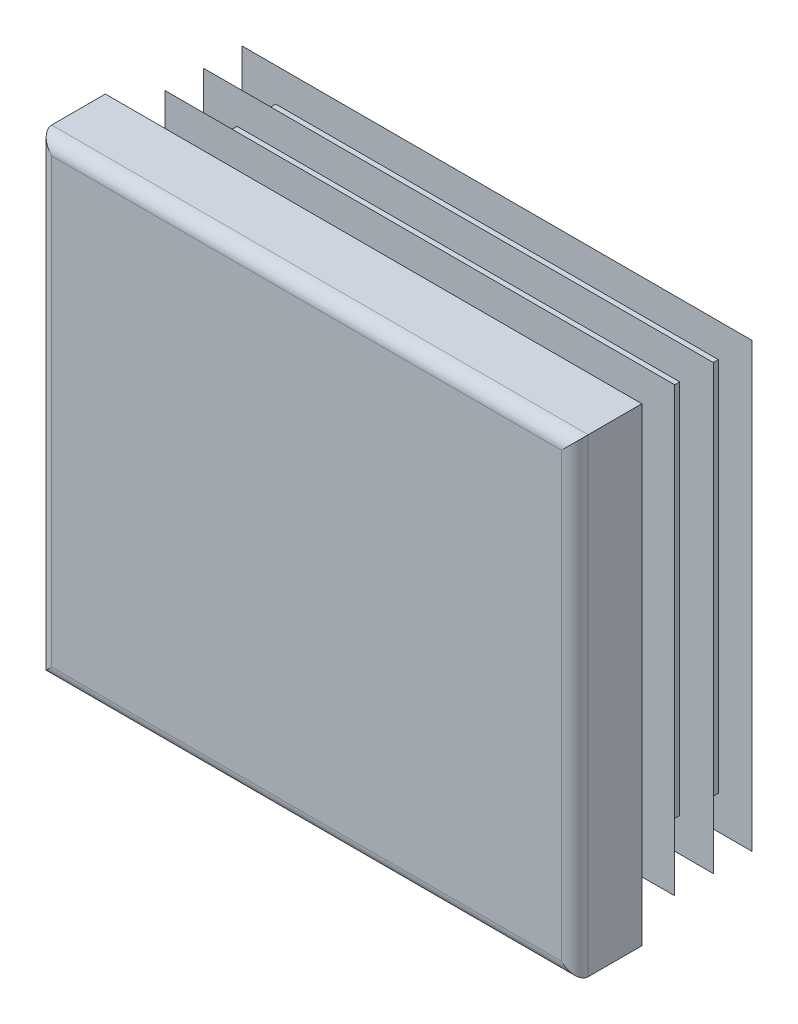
ISO-10303-21;
HEADER;
FILE_DESCRIPTION(('STEP AP214'),'2;1');
FILE_NAME('part.step','',(''),(''),'','','');
FILE_SCHEMA(('AUTOMOTIVE_DESIGN { 1 0 10303 214 1 1 1 1 }'));
ENDSEC;
DATA;
#1=APPLICATION_CONTEXT('core data for automotive mechanical design processes');
#2=APPLICATION_PROTOCOL_DEFINITION('international standard','automotive_design',2000,#1);
#3=PRODUCT_CONTEXT('',#1,'mechanical');
#4=PRODUCT('Part','Part','',(#3));
#5=PRODUCT_RELATED_PRODUCT_CATEGORY('part','',(#4));
#6=PRODUCT_DEFINITION_FORMATION('','',#4);
#7=PRODUCT_DEFINITION_CONTEXT('part definition',#1,'design');
#8=PRODUCT_DEFINITION('design','',#6,#7);
#9=PRODUCT_DEFINITION_SHAPE('','',#8);
#10=(LENGTH_UNIT() NAMED_UNIT(*) SI_UNIT(.MILLI.,.METRE.));
#11=(NAMED_UNIT(*) PLANE_ANGLE_UNIT() SI_UNIT($,.RADIAN.));
#12=(NAMED_UNIT(*) SI_UNIT($,.STERADIAN.) SOLID_ANGLE_UNIT());
#13=UNCERTAINTY_MEASURE_WITH_UNIT(LENGTH_MEASURE(1.E-05),#10,'distance_accuracy_value','');
#14=(GEOMETRIC_REPRESENTATION_CONTEXT(3) GLOBAL_UNCERTAINTY_ASSIGNED_CONTEXT((#13)) GLOBAL_UNIT_ASSIGNED_CONTEXT((#10,
#11,#12)) REPRESENTATION_CONTEXT('',''));
#15=CARTESIAN_POINT('',(0.,0.,0.));
#16=DIRECTION('',(0.,0.,1.));
#17=DIRECTION('',(1.,0.,0.));
#18=AXIS2_PLACEMENT_3D('',#15,#16,#17);
#19=CARTESIAN_POINT('',(19.,-17.5,5.));
#20=DIRECTION('',(0.,0.,-1.));
#21=DIRECTION('',(0.,1.,0.));
#22=AXIS2_PLACEMENT_3D('',#19,#20,#21);
#23=PLANE('',#22);
#24=DIRECTION('',(0.,1.,0.));
#25=VECTOR('',#24,1.);
#26=CARTESIAN_POINT('',(-19.,-17.5,5.));
#27=LINE('',#26,#25);
#28=CARTESIAN_POINT('',(-19.,-16.5,5.));
#29=VERTEX_POINT('',#28);
#30=CARTESIAN_POINT('',(-19.,16.5,5.));
#31=VERTEX_POINT('',#30);
#32=EDGE_CURVE('E310',#29,#31,#27,.T.);
#33=ORIENTED_EDGE('',*,*,#32,.F.);
#34=DIRECTION('',(-1.,0.,0.));
#35=VECTOR('',#34,1.);
#36=CARTESIAN_POINT('',(20.,-16.5,5.));
#37=LINE('',#36,#35);
#38=CARTESIAN_POINT('',(19.,-16.5,5.));
#39=VERTEX_POINT('',#38);
#40=EDGE_CURVE('E482',#39,#29,#37,.T.);
#41=ORIENTED_EDGE('',*,*,#40,.F.);
#42=DIRECTION('',(0.,1.,0.));
#43=VECTOR('',#42,1.);
#44=CARTESIAN_POINT('',(19.,-17.5,5.));
#45=LINE('',#44,#43);
#46=CARTESIAN_POINT('',(19.,16.5,5.));
#47=VERTEX_POINT('',#46);
#48=EDGE_CURVE('E305',#39,#47,#45,.T.);
#49=ORIENTED_EDGE('',*,*,#48,.T.);
#50=DIRECTION('',(-1.,0.,0.));
#51=VECTOR('',#50,1.);
#52=CARTESIAN_POINT('',(20.,16.5,5.));
#53=LINE('',#52,#51);
#54=EDGE_CURVE('E630',#47,#31,#53,.T.);
#55=ORIENTED_EDGE('',*,*,#54,.T.);
#56=EDGE_LOOP('',(#33,#41,#49,#55));
#57=FACE_BOUND('',#56,.T.);
#58=ADVANCED_FACE('F14',(#57),#23,.F.);
#59=CARTESIAN_POINT('',(-19.,-17.5,4.));
#60=DIRECTION('',(0.,1.,0.));
#61=DIRECTION('',(-1.,0.,0.));
#62=AXIS2_PLACEMENT_3D('',#59,#60,#61);
#63=CYLINDRICAL_SURFACE('',#62,1.);
#64=DIRECTION('',(0.,1.,0.));
#65=VECTOR('',#64,1.);
#66=CARTESIAN_POINT('',(-20.,-17.5,4.));
#67=LINE('',#66,#65);
#68=CARTESIAN_POINT('',(-20.,-17.5,4.));
#69=VERTEX_POINT('',#68);
#70=CARTESIAN_POINT('',(-20.,17.5,4.));
#71=VERTEX_POINT('',#70);
#72=EDGE_CURVE('E402',#69,#71,#67,.T.);
#73=ORIENTED_EDGE('',*,*,#72,.F.);
#74=CARTESIAN_POINT('',(-19.,-16.5,4.));
#75=DIRECTION('',(-0.707106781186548,0.707106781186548,0.));
#76=DIRECTION('',(0.707106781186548,0.707106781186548,0.));
#77=AXIS2_PLACEMENT_3D('',#74,#75,#76);
#78=ELLIPSE('',#77,1.4142135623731,1.);
#79=EDGE_CURVE('E59',#69,#29,#78,.T.);
#80=ORIENTED_EDGE('',*,*,#79,.T.);
#81=ORIENTED_EDGE('',*,*,#32,.T.);
#82=CARTESIAN_POINT('',(-19.,16.5,4.));
#83=DIRECTION('',(0.707106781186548,0.707106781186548,0.));
#84=DIRECTION('',(-0.707106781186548,0.707106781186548,0.));
#85=AXIS2_PLACEMENT_3D('',#82,#83,#84);
#86=ELLIPSE('',#85,1.4142135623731,1.);
#87=EDGE_CURVE('E306',#31,#71,#86,.F.);
#88=ORIENTED_EDGE('',*,*,#87,.T.);
#89=EDGE_LOOP('',(#73,#80,#81,#88));
#90=FACE_BOUND('',#89,.T.);
#91=ADVANCED_FACE('F16',(#90),#63,.T.);
#92=CARTESIAN_POINT('',(-20.,-17.5,4.));
#93=DIRECTION('',(1.,0.,0.));
#94=DIRECTION('',(0.,1.,0.));
#95=AXIS2_PLACEMENT_3D('',#92,#93,#94);
#96=PLANE('',#95);
#97=DIRECTION('',(0.,0.,-1.));
#98=VECTOR('',#97,1.);
#99=CARTESIAN_POINT('',(-20.,17.5,4.));
#100=LINE('',#99,#98);
#101=CARTESIAN_POINT('',(-20.,17.5,0.));
#102=VERTEX_POINT('',#101);
#103=EDGE_CURVE('E615',#71,#102,#100,.T.);
#104=ORIENTED_EDGE('',*,*,#103,.T.);
#105=DIRECTION('',(0.,1.,0.));
#106=VECTOR('',#105,1.);
#107=CARTESIAN_POINT('',(-20.,-17.5,0.));
#108=LINE('',#107,#106);
#109=CARTESIAN_POINT('',(-20.,-17.5,0.));
#110=VERTEX_POINT('',#109);
#111=EDGE_CURVE('E400',#110,#102,#108,.T.);
#112=ORIENTED_EDGE('',*,*,#111,.F.);
#113=DIRECTION('',(0.,0.,-1.));
#114=VECTOR('',#113,1.);
#115=CARTESIAN_POINT('',(-20.,-17.5,4.));
#116=LINE('',#115,#114);
#117=EDGE_CURVE('E616',#69,#110,#116,.T.);
#118=ORIENTED_EDGE('',*,*,#117,.F.);
#119=ORIENTED_EDGE('',*,*,#72,.T.);
#120=EDGE_LOOP('',(#104,#112,#118,#119));
#121=FACE_BOUND('',#120,.T.);
#122=ADVANCED_FACE('F697',(#121),#96,.F.);
#123=CARTESIAN_POINT('',(-16.5,-17.5,0.));
#124=DIRECTION('',(1.,0.,0.));
#125=DIRECTION('',(0.,1.,0.));
#126=AXIS2_PLACEMENT_3D('',#123,#124,#125);
#127=PLANE('',#126);
#128=DIRECTION('',(0.,1.,0.));
#129=VECTOR('',#128,1.);
#130=CARTESIAN_POINT('',(-16.5,-17.5,0.));
#131=LINE('',#130,#129);
#132=CARTESIAN_POINT('',(-16.5,-14.,0.));
#133=VERTEX_POINT('',#132);
#134=CARTESIAN_POINT('',(-16.5,14.,0.));
#135=VERTEX_POINT('',#134);
#136=EDGE_CURVE('E397',#133,#135,#131,.T.);
#137=ORIENTED_EDGE('',*,*,#136,.T.);
#138=DIRECTION('',(0.,0.,-1.));
#139=VECTOR('',#138,1.);
#140=CARTESIAN_POINT('',(-16.5,14.,0.));
#141=LINE('',#140,#139);
#142=CARTESIAN_POINT('',(-16.5,14.,-0.575));
#143=VERTEX_POINT('',#142);
#144=EDGE_CURVE('E495',#135,#143,#141,.T.);
#145=ORIENTED_EDGE('',*,*,#144,.T.);
#146=DIRECTION('',(0.,1.,0.));
#147=VECTOR('',#146,1.);
#148=CARTESIAN_POINT('',(-16.5,-17.5,-0.575));
#149=LINE('',#148,#147);
#150=CARTESIAN_POINT('',(-16.5,-14.,-0.575));
#151=VERTEX_POINT('',#150);
#152=EDGE_CURVE('E394',#151,#143,#149,.T.);
#153=ORIENTED_EDGE('',*,*,#152,.F.);
#154=DIRECTION('',(0.,0.,1.));
#155=VECTOR('',#154,1.);
#156=CARTESIAN_POINT('',(-16.5,-14.,0.));
#157=LINE('',#156,#155);
#158=EDGE_CURVE('E489',#151,#133,#157,.T.);
#159=ORIENTED_EDGE('',*,*,#158,.T.);
#160=EDGE_LOOP('',(#137,#145,#153,#159));
#161=FACE_BOUND('',#160,.T.);
#162=ADVANCED_FACE('F787',(#161),#127,.F.);
#163=CARTESIAN_POINT('',(-19.,-17.5,-0.575));
#164=DIRECTION('',(0.342020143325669,0.,0.939692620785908));
#165=DIRECTION('',(-0.939692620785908,0.,0.342020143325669));
#166=AXIS2_PLACEMENT_3D('',#163,#164,#165);
#167=PLANE('',#166);
#168=DIRECTION('',(0.,1.,0.));
#169=VECTOR('',#168,1.);
#170=CARTESIAN_POINT('',(-19.,-17.5,-0.575));
#171=LINE('',#170,#169);
#172=CARTESIAN_POINT('',(-19.,-16.5,-0.575));
#173=VERTEX_POINT('',#172);
#174=CARTESIAN_POINT('',(-19.,16.5,-0.575));
#175=VERTEX_POINT('',#174);
#176=EDGE_CURVE('E392',#173,#175,#171,.T.);
#177=ORIENTED_EDGE('',*,*,#176,.T.);
#178=DIRECTION('',(0.844349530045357,-0.438895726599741,-0.307318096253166));
#179=VECTOR('',#178,1.);
#180=CARTESIAN_POINT('',(-6.40023238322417,9.9505983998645,-5.16094037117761));
#181=LINE('',#180,#179);
#182=CARTESIAN_POINT('',(-16.5,15.2004915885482,-1.48492558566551));
#183=VERTEX_POINT('',#182);
#184=EDGE_CURVE('E519',#175,#183,#181,.T.);
#185=ORIENTED_EDGE('',*,*,#184,.T.);
#186=DIRECTION('',(0.,1.,0.));
#187=VECTOR('',#186,1.);
#188=CARTESIAN_POINT('',(-16.5,-17.5,-1.48492558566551));
#189=LINE('',#188,#187);
#190=CARTESIAN_POINT('',(-16.5,-15.2004915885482,-1.48492558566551));
#191=VERTEX_POINT('',#190);
#192=EDGE_CURVE('E389',#191,#183,#189,.T.);
#193=ORIENTED_EDGE('',*,*,#192,.F.);
#194=DIRECTION('',(-0.844349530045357,-0.438895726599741,0.307318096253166));
#195=VECTOR('',#194,1.);
#196=CARTESIAN_POINT('',(-19.3705814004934,-16.6926294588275,-0.440119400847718));
#197=LINE('',#196,#195);
#198=EDGE_CURVE('E507',#191,#173,#197,.T.);
#199=ORIENTED_EDGE('',*,*,#198,.T.);
#200=EDGE_LOOP('',(#177,#185,#193,#199));
#201=FACE_BOUND('',#200,.T.);
#202=ADVANCED_FACE('F783',(#201),#167,.F.);
#203=CARTESIAN_POINT('',(-16.5,-17.5,-1.48492558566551));
#204=DIRECTION('',(1.,0.,0.));
#205=DIRECTION('',(0.,1.,0.));
#206=AXIS2_PLACEMENT_3D('',#203,#204,#205);
#207=PLANE('',#206);
#208=ORIENTED_EDGE('',*,*,#192,.T.);
#209=DIRECTION('',(0.,-0.819152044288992,-0.573576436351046));
#210=VECTOR('',#209,1.);
#211=CARTESIAN_POINT('',(-16.5,-6.74186761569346,-16.8491309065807));
#212=LINE('',#211,#210);
#213=CARTESIAN_POINT('',(-16.5,14.,-2.32551884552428));
#214=VERTEX_POINT('',#213);
#215=EDGE_CURVE('E516',#183,#214,#212,.T.);
#216=ORIENTED_EDGE('',*,*,#215,.T.);
#217=DIRECTION('',(0.,0.,-1.));
#218=VECTOR('',#217,1.);
#219=CARTESIAN_POINT('',(-16.5,14.,-1.48492558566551));
#220=LINE('',#219,#218);
#221=CARTESIAN_POINT('',(-16.5,14.,-3.45));
#222=VERTEX_POINT('',#221);
#223=EDGE_CURVE('E525',#214,#222,#220,.T.);
#224=ORIENTED_EDGE('',*,*,#223,.T.);
#225=DIRECTION('',(0.,1.,0.));
#226=VECTOR('',#225,1.);
#227=CARTESIAN_POINT('',(-16.5,-17.5,-3.45));
#228=LINE('',#227,#226);
#229=CARTESIAN_POINT('',(-16.5,-14.,-3.45));
#230=VERTEX_POINT('',#229);
#231=EDGE_CURVE('E386',#230,#222,#228,.T.);
#232=ORIENTED_EDGE('',*,*,#231,.F.);
#233=DIRECTION('',(0.,0.,1.));
#234=VECTOR('',#233,1.);
#235=CARTESIAN_POINT('',(-16.5,-14.,-1.48492558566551));
#236=LINE('',#235,#234);
#237=CARTESIAN_POINT('',(-16.5,-14.,-2.32551884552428));
#238=VERTEX_POINT('',#237);
#239=EDGE_CURVE('E522',#230,#238,#236,.T.);
#240=ORIENTED_EDGE('',*,*,#239,.T.);
#241=DIRECTION('',(0.,-0.819152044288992,0.573576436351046));
#242=VECTOR('',#241,1.);
#243=CARTESIAN_POINT('',(-16.5,-16.7434848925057,-0.404510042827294));
#244=LINE('',#243,#242);
#245=EDGE_CURVE('E504',#238,#191,#244,.T.);
#246=ORIENTED_EDGE('',*,*,#245,.T.);
#247=EDGE_LOOP('',(#208,#216,#224,#232,#240,#246));
#248=FACE_BOUND('',#247,.T.);
#249=ADVANCED_FACE('F779',(#248),#207,.F.);
#250=CARTESIAN_POINT('',(-19.,-17.5,-3.45));
#251=DIRECTION('',(0.342020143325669,0.,0.939692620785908));
#252=DIRECTION('',(-0.939692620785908,0.,0.342020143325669));
#253=AXIS2_PLACEMENT_3D('',#250,#251,#252);
#254=PLANE('',#253);
#255=DIRECTION('',(0.,1.,0.));
#256=VECTOR('',#255,1.);
#257=CARTESIAN_POINT('',(-19.,-17.5,-3.45));
#258=LINE('',#257,#256);
#259=CARTESIAN_POINT('',(-19.,-16.5,-3.45));
#260=VERTEX_POINT('',#259);
#261=CARTESIAN_POINT('',(-19.,16.5,-3.45));
#262=VERTEX_POINT('',#261);
#263=EDGE_CURVE('E384',#260,#262,#258,.T.);
#264=ORIENTED_EDGE('',*,*,#263,.T.);
#265=DIRECTION('',(0.844349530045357,-0.438895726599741,-0.307318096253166));
#266=VECTOR('',#265,1.);
#267=CARTESIAN_POINT('',(-6.40023238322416,9.95059839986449,-8.03594037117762));
#268=LINE('',#267,#266);
#269=CARTESIAN_POINT('',(-16.5,15.2004915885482,-4.35992558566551));
#270=VERTEX_POINT('',#269);
#271=EDGE_CURVE('E549',#262,#270,#268,.T.);
#272=ORIENTED_EDGE('',*,*,#271,.T.);
#273=DIRECTION('',(0.,1.,0.));
#274=VECTOR('',#273,1.);
#275=CARTESIAN_POINT('',(-16.5,-17.5,-4.35992558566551));
#276=LINE('',#275,#274);
#277=CARTESIAN_POINT('',(-16.5,-15.2004915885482,-4.35992558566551));
#278=VERTEX_POINT('',#277);
#279=EDGE_CURVE('E381',#278,#270,#276,.T.);
#280=ORIENTED_EDGE('',*,*,#279,.F.);
#281=DIRECTION('',(-0.844349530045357,-0.43889572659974,0.307318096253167));
#282=VECTOR('',#281,1.);
#283=CARTESIAN_POINT('',(-19.3705814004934,-16.6926294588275,-3.31511940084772));
#284=LINE('',#283,#282);
#285=EDGE_CURVE('E537',#278,#260,#284,.T.);
#286=ORIENTED_EDGE('',*,*,#285,.T.);
#287=EDGE_LOOP('',(#264,#272,#280,#286));
#288=FACE_BOUND('',#287,.T.);
#289=ADVANCED_FACE('F775',(#288),#254,.F.);
#290=CARTESIAN_POINT('',(-16.5,-17.5,-4.35992558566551));
#291=DIRECTION('',(1.,0.,0.));
#292=DIRECTION('',(0.,1.,0.));
#293=AXIS2_PLACEMENT_3D('',#290,#291,#292);
#294=PLANE('',#293);
#295=ORIENTED_EDGE('',*,*,#279,.T.);
#296=DIRECTION('',(0.,-0.819152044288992,-0.573576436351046));
#297=VECTOR('',#296,1.);
#298=CARTESIAN_POINT('',(-16.5,-6.74186761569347,-19.7241309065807));
#299=LINE('',#298,#297);
#300=CARTESIAN_POINT('',(-16.5,14.,-5.20051884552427));
#301=VERTEX_POINT('',#300);
#302=EDGE_CURVE('E546',#270,#301,#299,.T.);
#303=ORIENTED_EDGE('',*,*,#302,.T.);
#304=DIRECTION('',(0.,0.,-1.));
#305=VECTOR('',#304,1.);
#306=CARTESIAN_POINT('',(-16.5,14.,-4.35992558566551));
#307=LINE('',#306,#305);
#308=CARTESIAN_POINT('',(-16.5,14.,-6.325));
#309=VERTEX_POINT('',#308);
#310=EDGE_CURVE('E555',#301,#309,#307,.T.);
#311=ORIENTED_EDGE('',*,*,#310,.T.);
#312=DIRECTION('',(0.,1.,0.));
#313=VECTOR('',#312,1.);
#314=CARTESIAN_POINT('',(-16.5,-17.5,-6.325));
#315=LINE('',#314,#313);
#316=CARTESIAN_POINT('',(-16.5,-14.,-6.325));
#317=VERTEX_POINT('',#316);
#318=EDGE_CURVE('E378',#317,#309,#315,.T.);
#319=ORIENTED_EDGE('',*,*,#318,.F.);
#320=DIRECTION('',(0.,0.,1.));
#321=VECTOR('',#320,1.);
#322=CARTESIAN_POINT('',(-16.5,-14.,-4.35992558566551));
#323=LINE('',#322,#321);
#324=CARTESIAN_POINT('',(-16.5,-14.,-5.20051884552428));
#325=VERTEX_POINT('',#324);
#326=EDGE_CURVE('E552',#317,#325,#323,.T.);
#327=ORIENTED_EDGE('',*,*,#326,.T.);
#328=DIRECTION('',(0.,-0.819152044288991,0.573576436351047));
#329=VECTOR('',#328,1.);
#330=CARTESIAN_POINT('',(-16.5,-16.7434848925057,-3.27951004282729));
#331=LINE('',#330,#329);
#332=EDGE_CURVE('E534',#325,#278,#331,.T.);
#333=ORIENTED_EDGE('',*,*,#332,.T.);
#334=EDGE_LOOP('',(#295,#303,#311,#319,#327,#333));
#335=FACE_BOUND('',#334,.T.);
#336=ADVANCED_FACE('F771',(#335),#294,.F.);
#337=CARTESIAN_POINT('',(-19.,-17.5,-6.325));
#338=DIRECTION('',(0.34202014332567,0.,0.939692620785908));
#339=DIRECTION('',(-0.939692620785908,0.,0.34202014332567));
#340=AXIS2_PLACEMENT_3D('',#337,#338,#339);
#341=PLANE('',#340);
#342=DIRECTION('',(0.,1.,0.));
#343=VECTOR('',#342,1.);
#344=CARTESIAN_POINT('',(-19.,-17.5,-6.325));
#345=LINE('',#344,#343);
#346=CARTESIAN_POINT('',(-19.,-16.5,-6.325));
#347=VERTEX_POINT('',#346);
#348=CARTESIAN_POINT('',(-19.,16.5,-6.325));
#349=VERTEX_POINT('',#348);
#350=EDGE_CURVE('E376',#347,#349,#345,.T.);
#351=ORIENTED_EDGE('',*,*,#350,.T.);
#352=DIRECTION('',(0.844349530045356,-0.438895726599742,-0.307318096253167));
#353=VECTOR('',#352,1.);
#354=CARTESIAN_POINT('',(-6.40023238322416,9.95059839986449,-10.9109403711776));
#355=LINE('',#354,#353);
#356=CARTESIAN_POINT('',(-16.5,15.2004915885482,-7.23492558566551));
#357=VERTEX_POINT('',#356);
#358=EDGE_CURVE('E579',#349,#357,#355,.T.);
#359=ORIENTED_EDGE('',*,*,#358,.T.);
#360=DIRECTION('',(0.,1.,0.));
#361=VECTOR('',#360,1.);
#362=CARTESIAN_POINT('',(-16.5,-17.5,-7.23492558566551));
#363=LINE('',#362,#361);
#364=CARTESIAN_POINT('',(-16.5,-15.2004915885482,-7.23492558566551));
#365=VERTEX_POINT('',#364);
#366=EDGE_CURVE('E373',#365,#357,#363,.T.);
#367=ORIENTED_EDGE('',*,*,#366,.F.);
#368=DIRECTION('',(-0.844349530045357,-0.43889572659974,0.307318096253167));
#369=VECTOR('',#368,1.);
#370=CARTESIAN_POINT('',(-19.3705814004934,-16.6926294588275,-6.19011940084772));
#371=LINE('',#370,#369);
#372=EDGE_CURVE('E567',#365,#347,#371,.T.);
#373=ORIENTED_EDGE('',*,*,#372,.T.);
#374=EDGE_LOOP('',(#351,#359,#367,#373));
#375=FACE_BOUND('',#374,.T.);
#376=ADVANCED_FACE('F767',(#375),#341,.F.);
#377=CARTESIAN_POINT('',(-16.5,-17.5,-7.23492558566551));
#378=DIRECTION('',(1.,0.,0.));
#379=DIRECTION('',(0.,1.,0.));
#380=AXIS2_PLACEMENT_3D('',#377,#378,#379);
#381=PLANE('',#380);
#382=ORIENTED_EDGE('',*,*,#366,.T.);
#383=DIRECTION('',(0.,-0.819152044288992,-0.573576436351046));
#384=VECTOR('',#383,1.);
#385=CARTESIAN_POINT('',(-16.5,-6.74186761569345,-22.5991309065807));
#386=LINE('',#385,#384);
#387=CARTESIAN_POINT('',(-16.5,14.,-8.07551884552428));
#388=VERTEX_POINT('',#387);
#389=EDGE_CURVE('E576',#357,#388,#386,.T.);
#390=ORIENTED_EDGE('',*,*,#389,.T.);
#391=DIRECTION('',(0.,0.,-1.));
#392=VECTOR('',#391,1.);
#393=CARTESIAN_POINT('',(-16.5,14.,-7.23492558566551));
#394=LINE('',#393,#392);
#395=CARTESIAN_POINT('',(-16.5,14.,-9.2));
#396=VERTEX_POINT('',#395);
#397=EDGE_CURVE('E585',#388,#396,#394,.T.);
#398=ORIENTED_EDGE('',*,*,#397,.T.);
#399=DIRECTION('',(0.,1.,0.));
#400=VECTOR('',#399,1.);
#401=CARTESIAN_POINT('',(-16.5,-17.5,-9.2));
#402=LINE('',#401,#400);
#403=CARTESIAN_POINT('',(-16.5,-14.,-9.2));
#404=VERTEX_POINT('',#403);
#405=EDGE_CURVE('E370',#404,#396,#402,.T.);
#406=ORIENTED_EDGE('',*,*,#405,.F.);
#407=DIRECTION('',(0.,0.,1.));
#408=VECTOR('',#407,1.);
#409=CARTESIAN_POINT('',(-16.5,-14.,-7.23492558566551));
#410=LINE('',#409,#408);
#411=CARTESIAN_POINT('',(-16.5,-14.,-8.07551884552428));
#412=VERTEX_POINT('',#411);
#413=EDGE_CURVE('E582',#404,#412,#410,.T.);
#414=ORIENTED_EDGE('',*,*,#413,.T.);
#415=DIRECTION('',(0.,-0.819152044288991,0.573576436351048));
#416=VECTOR('',#415,1.);
#417=CARTESIAN_POINT('',(-16.5,-16.7434848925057,-6.15451004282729));
#418=LINE('',#417,#416);
#419=EDGE_CURVE('E564',#412,#365,#418,.T.);
#420=ORIENTED_EDGE('',*,*,#419,.T.);
#421=EDGE_LOOP('',(#382,#390,#398,#406,#414,#420));
#422=FACE_BOUND('',#421,.T.);
#423=ADVANCED_FACE('F764',(#422),#381,.F.);
#424=CARTESIAN_POINT('',(-19.,-17.5,-9.2));
#425=DIRECTION('',(0.342020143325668,0.,0.939692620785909));
#426=DIRECTION('',(-0.939692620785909,0.,0.342020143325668));
#427=AXIS2_PLACEMENT_3D('',#424,#425,#426);
#428=PLANE('',#427);
#429=DIRECTION('',(0.,1.,0.));
#430=VECTOR('',#429,1.);
#431=CARTESIAN_POINT('',(-19.,-17.5,-9.2));
#432=LINE('',#431,#430);
#433=CARTESIAN_POINT('',(-19.,-16.5,-9.2));
#434=VERTEX_POINT('',#433);
#435=CARTESIAN_POINT('',(-19.,16.5,-9.2));
#436=VERTEX_POINT('',#435);
#437=EDGE_CURVE('E368',#434,#436,#432,.T.);
#438=ORIENTED_EDGE('',*,*,#437,.T.);
#439=DIRECTION('',(0.844349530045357,-0.438895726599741,-0.307318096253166));
#440=VECTOR('',#439,1.);
#441=CARTESIAN_POINT('',(-6.40023238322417,9.95059839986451,-13.7859403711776));
#442=LINE('',#441,#440);
#443=CARTESIAN_POINT('',(-16.5,15.2004915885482,-10.1099255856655));
#444=VERTEX_POINT('',#443);
#445=EDGE_CURVE('E607',#436,#444,#442,.T.);
#446=ORIENTED_EDGE('',*,*,#445,.T.);
#447=DIRECTION('',(0.,1.,0.));
#448=VECTOR('',#447,1.);
#449=CARTESIAN_POINT('',(-16.5,-17.5,-10.1099255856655));
#450=LINE('',#449,#448);
#451=CARTESIAN_POINT('',(-16.5,-15.2004915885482,-10.1099255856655));
#452=VERTEX_POINT('',#451);
#453=EDGE_CURVE('E365',#452,#444,#450,.T.);
#454=ORIENTED_EDGE('',*,*,#453,.F.);
#455=DIRECTION('',(-0.844349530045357,-0.43889572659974,0.307318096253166));
#456=VECTOR('',#455,1.);
#457=CARTESIAN_POINT('',(-19.3705814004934,-16.6926294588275,-9.06511940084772));
#458=LINE('',#457,#456);
#459=EDGE_CURVE('E595',#452,#434,#458,.T.);
#460=ORIENTED_EDGE('',*,*,#459,.T.);
#461=EDGE_LOOP('',(#438,#446,#454,#460));
#462=FACE_BOUND('',#461,.T.);
#463=ADVANCED_FACE('F675',(#462),#428,.F.);
#464=CARTESIAN_POINT('',(-16.5,-17.5,-10.1099255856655));
#465=DIRECTION('',(1.,0.,0.));
#466=DIRECTION('',(0.,1.,0.));
#467=AXIS2_PLACEMENT_3D('',#464,#465,#466);
#468=PLANE('',#467);
#469=ORIENTED_EDGE('',*,*,#453,.T.);
#470=DIRECTION('',(0.,-0.819152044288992,-0.573576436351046));
#471=VECTOR('',#470,1.);
#472=CARTESIAN_POINT('',(-16.5,-6.74186761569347,-25.4741309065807));
#473=LINE('',#472,#471);
#474=CARTESIAN_POINT('',(-16.5,14.,-10.9505188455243));
#475=VERTEX_POINT('',#474);
#476=EDGE_CURVE('E604',#444,#475,#473,.T.);
#477=ORIENTED_EDGE('',*,*,#476,.T.);
#478=DIRECTION('',(0.,0.,-1.));
#479=VECTOR('',#478,1.);
#480=CARTESIAN_POINT('',(-16.5,14.,-10.1099255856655));
#481=LINE('',#480,#479);
#482=CARTESIAN_POINT('',(-16.5,14.,-11.5));
#483=VERTEX_POINT('',#482);
#484=EDGE_CURVE('E613',#475,#483,#481,.T.);
#485=ORIENTED_EDGE('',*,*,#484,.T.);
#486=DIRECTION('',(0.,1.,0.));
#487=VECTOR('',#486,1.);
#488=CARTESIAN_POINT('',(-16.5,-17.5,-11.5));
#489=LINE('',#488,#487);
#490=CARTESIAN_POINT('',(-16.5,-14.,-11.5));
#491=VERTEX_POINT('',#490);
#492=EDGE_CURVE('E362',#491,#483,#489,.T.);
#493=ORIENTED_EDGE('',*,*,#492,.F.);
#494=DIRECTION('',(0.,0.,1.));
#495=VECTOR('',#494,1.);
#496=CARTESIAN_POINT('',(-16.5,-14.,-10.1099255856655));
#497=LINE('',#496,#495);
#498=CARTESIAN_POINT('',(-16.5,-14.,-10.9505188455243));
#499=VERTEX_POINT('',#498);
#500=EDGE_CURVE('E610',#491,#499,#497,.T.);
#501=ORIENTED_EDGE('',*,*,#500,.T.);
#502=DIRECTION('',(0.,-0.819152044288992,0.573576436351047));
#503=VECTOR('',#502,1.);
#504=CARTESIAN_POINT('',(-16.5,-16.7434848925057,-9.02951004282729));
#505=LINE('',#504,#503);
#506=EDGE_CURVE('E592',#499,#452,#505,.T.);
#507=ORIENTED_EDGE('',*,*,#506,.T.);
#508=EDGE_LOOP('',(#469,#477,#485,#493,#501,#507));
#509=FACE_BOUND('',#508,.T.);
#510=ADVANCED_FACE('F677',(#509),#468,.F.);
#511=CARTESIAN_POINT('',(-16.5,-17.5,-11.5));
#512=DIRECTION('',(0.,0.,1.));
#513=DIRECTION('',(0.,-1.,0.));
#514=AXIS2_PLACEMENT_3D('',#511,#512,#513);
#515=PLANE('',#514);
#516=ORIENTED_EDGE('',*,*,#492,.T.);
#517=DIRECTION('',(-1.,0.,0.));
#518=VECTOR('',#517,1.);
#519=CARTESIAN_POINT('',(20.,14.,-11.5));
#520=LINE('',#519,#518);
#521=CARTESIAN_POINT('',(16.5,14.,-11.5));
#522=VERTEX_POINT('',#521);
#523=EDGE_CURVE('E438',#522,#483,#520,.T.);
#524=ORIENTED_EDGE('',*,*,#523,.F.);
#525=DIRECTION('',(0.,1.,0.));
#526=VECTOR('',#525,1.);
#527=CARTESIAN_POINT('',(16.5,-17.5,-11.5));
#528=LINE('',#527,#526);
#529=CARTESIAN_POINT('',(16.5,-14.,-11.5));
#530=VERTEX_POINT('',#529);
#531=EDGE_CURVE('E359',#530,#522,#528,.T.);
#532=ORIENTED_EDGE('',*,*,#531,.F.);
#533=DIRECTION('',(-1.,0.,0.));
#534=VECTOR('',#533,1.);
#535=CARTESIAN_POINT('',(20.,-14.,-11.5));
#536=LINE('',#535,#534);
#537=EDGE_CURVE('E436',#530,#491,#536,.T.);
#538=ORIENTED_EDGE('',*,*,#537,.T.);
#539=EDGE_LOOP('',(#516,#524,#532,#538));
#540=FACE_BOUND('',#539,.T.);
#541=ADVANCED_FACE('F435',(#540),#515,.F.);
#542=CARTESIAN_POINT('',(16.5,-17.5,-11.5));
#543=DIRECTION('',(-1.,0.,0.));
#544=DIRECTION('',(0.,-1.,0.));
#545=AXIS2_PLACEMENT_3D('',#542,#543,#544);
#546=PLANE('',#545);
#547=DIRECTION('',(0.,0.,1.));
#548=VECTOR('',#547,1.);
#549=CARTESIAN_POINT('',(16.5,14.,-11.5));
#550=LINE('',#549,#548);
#551=CARTESIAN_POINT('',(16.5,14.,-10.9505188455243));
#552=VERTEX_POINT('',#551);
#553=EDGE_CURVE('E9',#522,#552,#550,.T.);
#554=ORIENTED_EDGE('',*,*,#553,.T.);
#555=DIRECTION('',(0.,0.819152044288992,0.573576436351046));
#556=VECTOR('',#555,1.);
#557=CARTESIAN_POINT('',(16.5,-7.39498895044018,-25.9314513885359));
#558=LINE('',#557,#556);
#559=CARTESIAN_POINT('',(16.5,15.2004915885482,-10.1099255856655));
#560=VERTEX_POINT('',#559);
#561=EDGE_CURVE('E601',#552,#560,#558,.T.);
#562=ORIENTED_EDGE('',*,*,#561,.T.);
#563=DIRECTION('',(0.,1.,0.));
#564=VECTOR('',#563,1.);
#565=CARTESIAN_POINT('',(16.5,-17.5,-10.1099255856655));
#566=LINE('',#565,#564);
#567=CARTESIAN_POINT('',(16.5,-15.2004915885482,-10.1099255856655));
#568=VERTEX_POINT('',#567);
#569=EDGE_CURVE('E356',#568,#560,#566,.T.);
#570=ORIENTED_EDGE('',*,*,#569,.F.);
#571=DIRECTION('',(0.,0.819152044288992,-0.573576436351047));
#572=VECTOR('',#571,1.);
#573=CARTESIAN_POINT('',(16.5,-16.0903635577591,-9.48683052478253));
#574=LINE('',#573,#572);
#575=CARTESIAN_POINT('',(16.5,-14.,-10.9505188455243));
#576=VERTEX_POINT('',#575);
#577=EDGE_CURVE('E428',#568,#576,#574,.T.);
#578=ORIENTED_EDGE('',*,*,#577,.T.);
#579=DIRECTION('',(0.,0.,-1.));
#580=VECTOR('',#579,1.);
#581=CARTESIAN_POINT('',(16.5,-14.,-11.5));
#582=LINE('',#581,#580);
#583=EDGE_CURVE('E23',#576,#530,#582,.T.);
#584=ORIENTED_EDGE('',*,*,#583,.T.);
#585=ORIENTED_EDGE('',*,*,#531,.T.);
#586=EDGE_LOOP('',(#554,#562,#570,#578,#584,#585));
#587=FACE_BOUND('',#586,.T.);
#588=ADVANCED_FACE('F426',(#587),#546,.F.);
#589=CARTESIAN_POINT('',(16.5,-17.5,-10.1099255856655));
#590=DIRECTION('',(-0.342020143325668,0.,0.939692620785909));
#591=DIRECTION('',(-0.939692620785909,0.,-0.342020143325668));
#592=AXIS2_PLACEMENT_3D('',#589,#590,#591);
#593=PLANE('',#592);
#594=ORIENTED_EDGE('',*,*,#569,.T.);
#595=DIRECTION('',(0.844349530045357,0.438895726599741,0.307318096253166));
#596=VECTOR('',#595,1.);
#597=CARTESIAN_POINT('',(4.38180603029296,8.90141359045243,-14.5205874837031));
#598=LINE('',#597,#596);
#599=CARTESIAN_POINT('',(19.,16.5,-9.2));
#600=VERTEX_POINT('',#599);
#601=EDGE_CURVE('E598',#560,#600,#598,.T.);
#602=ORIENTED_EDGE('',*,*,#601,.T.);
#603=DIRECTION('',(0.,1.,0.));
#604=VECTOR('',#603,1.);
#605=CARTESIAN_POINT('',(19.,-17.5,-9.2));
#606=LINE('',#605,#604);
#607=CARTESIAN_POINT('',(19.,-16.5,-9.2));
#608=VERTEX_POINT('',#607);
#609=EDGE_CURVE('E353',#608,#600,#606,.T.);
#610=ORIENTED_EDGE('',*,*,#609,.F.);
#611=DIRECTION('',(-0.844349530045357,0.43889572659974,-0.307318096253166));
#612=VECTOR('',#611,1.);
#613=CARTESIAN_POINT('',(17.3521550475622,-15.6434446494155,-9.79976651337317));
#614=LINE('',#613,#612);
#615=EDGE_CURVE('E588',#608,#568,#614,.T.);
#616=ORIENTED_EDGE('',*,*,#615,.T.);
#617=EDGE_LOOP('',(#594,#602,#610,#616));
#618=FACE_BOUND('',#617,.T.);
#619=ADVANCED_FACE('F752',(#618),#593,.F.);
#620=CARTESIAN_POINT('',(19.,-17.5,-9.2));
#621=DIRECTION('',(0.,0.,-1.));
#622=DIRECTION('',(0.,1.,0.));
#623=AXIS2_PLACEMENT_3D('',#620,#621,#622);
#624=PLANE('',#623);
#625=ORIENTED_EDGE('',*,*,#609,.T.);
#626=DIRECTION('',(-1.,0.,0.));
#627=VECTOR('',#626,1.);
#628=CARTESIAN_POINT('',(20.,16.5,-9.2));
#629=LINE('',#628,#627);
#630=EDGE_CURVE('E444',#600,#436,#629,.T.);
#631=ORIENTED_EDGE('',*,*,#630,.T.);
#632=ORIENTED_EDGE('',*,*,#437,.F.);
#633=DIRECTION('',(-1.,0.,0.));
#634=VECTOR('',#633,1.);
#635=CARTESIAN_POINT('',(20.,-16.5,-9.2));
#636=LINE('',#635,#634);
#637=EDGE_CURVE('E451',#608,#434,#636,.T.);
#638=ORIENTED_EDGE('',*,*,#637,.F.);
#639=EDGE_LOOP('',(#625,#631,#632,#638));
#640=FACE_BOUND('',#639,.T.);
#641=ORIENTED_EDGE('',*,*,#405,.T.);
#642=DIRECTION('',(-1.,0.,0.));
#643=VECTOR('',#642,1.);
#644=CARTESIAN_POINT('',(20.,14.,-9.2));
#645=LINE('',#644,#643);
#646=CARTESIAN_POINT('',(16.5,14.,-9.2));
#647=VERTEX_POINT('',#646);
#648=EDGE_CURVE('E663',#647,#396,#645,.T.);
#649=ORIENTED_EDGE('',*,*,#648,.F.);
#650=DIRECTION('',(0.,1.,0.));
#651=VECTOR('',#650,1.);
#652=CARTESIAN_POINT('',(16.5,-17.5,-9.2));
#653=LINE('',#652,#651);
#654=CARTESIAN_POINT('',(16.5,-14.,-9.2));
#655=VERTEX_POINT('',#654);
#656=EDGE_CURVE('E350',#655,#647,#653,.T.);
#657=ORIENTED_EDGE('',*,*,#656,.F.);
#658=DIRECTION('',(-1.,0.,0.));
#659=VECTOR('',#658,1.);
#660=CARTESIAN_POINT('',(20.,-14.,-9.2));
#661=LINE('',#660,#659);
#662=EDGE_CURVE('E453',#655,#404,#661,.T.);
#663=ORIENTED_EDGE('',*,*,#662,.T.);
#664=EDGE_LOOP('',(#641,#649,#657,#663));
#665=FACE_BOUND('',#664,.T.);
#666=ADVANCED_FACE('F667',(#640,#665),#624,.F.);
#667=CARTESIAN_POINT('',(16.5,-17.5,-9.2));
#668=DIRECTION('',(-1.,0.,0.));
#669=DIRECTION('',(0.,-1.,0.));
#670=AXIS2_PLACEMENT_3D('',#667,#668,#669);
#671=PLANE('',#670);
#672=DIRECTION('',(0.,0.,1.));
#673=VECTOR('',#672,1.);
#674=CARTESIAN_POINT('',(16.5,14.,-9.2));
#675=LINE('',#674,#673);
#676=CARTESIAN_POINT('',(16.5,14.,-8.07551884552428));
#677=VERTEX_POINT('',#676);
#678=EDGE_CURVE('E420',#647,#677,#675,.T.);
#679=ORIENTED_EDGE('',*,*,#678,.T.);
#680=DIRECTION('',(0.,0.819152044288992,0.573576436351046));
#681=VECTOR('',#680,1.);
#682=CARTESIAN_POINT('',(16.5,-7.6651505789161,-23.2456205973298));
#683=LINE('',#682,#681);
#684=CARTESIAN_POINT('',(16.5,15.2004915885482,-7.23492558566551));
#685=VERTEX_POINT('',#684);
#686=EDGE_CURVE('E573',#677,#685,#683,.T.);
#687=ORIENTED_EDGE('',*,*,#686,.T.);
#688=DIRECTION('',(0.,1.,0.));
#689=VECTOR('',#688,1.);
#690=CARTESIAN_POINT('',(16.5,-17.5,-7.23492558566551));
#691=LINE('',#690,#689);
#692=CARTESIAN_POINT('',(16.5,-15.2004915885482,-7.23492558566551));
#693=VERTEX_POINT('',#692);
#694=EDGE_CURVE('E347',#693,#685,#691,.T.);
#695=ORIENTED_EDGE('',*,*,#694,.F.);
#696=DIRECTION('',(0.,0.819152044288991,-0.573576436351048));
#697=VECTOR('',#696,1.);
#698=CARTESIAN_POINT('',(16.5,-15.8202019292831,-6.8009997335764));
#699=LINE('',#698,#697);
#700=CARTESIAN_POINT('',(16.5,-14.,-8.07551884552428));
#701=VERTEX_POINT('',#700);
#702=EDGE_CURVE('E561',#693,#701,#699,.T.);
#703=ORIENTED_EDGE('',*,*,#702,.T.);
#704=DIRECTION('',(0.,0.,-1.));
#705=VECTOR('',#704,1.);
#706=CARTESIAN_POINT('',(16.5,-14.,-9.2));
#707=LINE('',#706,#705);
#708=EDGE_CURVE('E417',#701,#655,#707,.T.);
#709=ORIENTED_EDGE('',*,*,#708,.T.);
#710=ORIENTED_EDGE('',*,*,#656,.T.);
#711=EDGE_LOOP('',(#679,#687,#695,#703,#709,#710));
#712=FACE_BOUND('',#711,.T.);
#713=ADVANCED_FACE('F745',(#712),#671,.F.);
#714=CARTESIAN_POINT('',(16.5,-17.5,-7.23492558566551));
#715=DIRECTION('',(-0.342020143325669,0.,0.939692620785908));
#716=DIRECTION('',(-0.939692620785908,0.,-0.342020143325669));
#717=AXIS2_PLACEMENT_3D('',#714,#715,#716);
#718=PLANE('',#717);
#719=ORIENTED_EDGE('',*,*,#694,.T.);
#720=DIRECTION('',(0.844349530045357,0.438895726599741,0.307318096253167));
#721=VECTOR('',#720,1.);
#722=CARTESIAN_POINT('',(4.38180603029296,8.90141359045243,-11.6455874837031));
#723=LINE('',#722,#721);
#724=CARTESIAN_POINT('',(19.,16.5,-6.325));
#725=VERTEX_POINT('',#724);
#726=EDGE_CURVE('E570',#685,#725,#723,.T.);
#727=ORIENTED_EDGE('',*,*,#726,.T.);
#728=DIRECTION('',(0.,1.,0.));
#729=VECTOR('',#728,1.);
#730=CARTESIAN_POINT('',(19.,-17.5,-6.325));
#731=LINE('',#730,#729);
#732=CARTESIAN_POINT('',(19.,-16.5,-6.325));
#733=VERTEX_POINT('',#732);
#734=EDGE_CURVE('E344',#733,#725,#731,.T.);
#735=ORIENTED_EDGE('',*,*,#734,.F.);
#736=DIRECTION('',(-0.844349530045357,0.43889572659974,-0.307318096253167));
#737=VECTOR('',#736,1.);
#738=CARTESIAN_POINT('',(17.3521550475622,-15.6434446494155,-6.92476651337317));
#739=LINE('',#738,#737);
#740=EDGE_CURVE('E558',#733,#693,#739,.T.);
#741=ORIENTED_EDGE('',*,*,#740,.T.);
#742=EDGE_LOOP('',(#719,#727,#735,#741));
#743=FACE_BOUND('',#742,.T.);
#744=ADVANCED_FACE('F741',(#743),#718,.F.);
#745=CARTESIAN_POINT('',(19.,-17.5,-6.325));
#746=DIRECTION('',(0.,0.,-1.));
#747=DIRECTION('',(0.,1.,0.));
#748=AXIS2_PLACEMENT_3D('',#745,#746,#747);
#749=PLANE('',#748);
#750=ORIENTED_EDGE('',*,*,#734,.T.);
#751=DIRECTION('',(-1.,0.,0.));
#752=VECTOR('',#751,1.);
#753=CARTESIAN_POINT('',(20.,16.5,-6.325));
#754=LINE('',#753,#752);
#755=EDGE_CURVE('E657',#725,#349,#754,.T.);
#756=ORIENTED_EDGE('',*,*,#755,.T.);
#757=ORIENTED_EDGE('',*,*,#350,.F.);
#758=DIRECTION('',(-1.,0.,0.));
#759=VECTOR('',#758,1.);
#760=CARTESIAN_POINT('',(20.,-16.5,-6.325));
#761=LINE('',#760,#759);
#762=EDGE_CURVE('E459',#733,#347,#761,.T.);
#763=ORIENTED_EDGE('',*,*,#762,.F.);
#764=EDGE_LOOP('',(#750,#756,#757,#763));
#765=FACE_BOUND('',#764,.T.);
#766=ORIENTED_EDGE('',*,*,#318,.T.);
#767=DIRECTION('',(-1.,0.,0.));
#768=VECTOR('',#767,1.);
#769=CARTESIAN_POINT('',(20.,14.,-6.325));
#770=LINE('',#769,#768);
#771=CARTESIAN_POINT('',(16.5,14.,-6.325));
#772=VERTEX_POINT('',#771);
#773=EDGE_CURVE('E655',#772,#309,#770,.T.);
#774=ORIENTED_EDGE('',*,*,#773,.F.);
#775=DIRECTION('',(0.,1.,0.));
#776=VECTOR('',#775,1.);
#777=CARTESIAN_POINT('',(16.5,-17.5,-6.325));
#778=LINE('',#777,#776);
#779=CARTESIAN_POINT('',(16.5,-14.,-6.325));
#780=VERTEX_POINT('',#779);
#781=EDGE_CURVE('E341',#780,#772,#778,.T.);
#782=ORIENTED_EDGE('',*,*,#781,.F.);
#783=DIRECTION('',(-1.,0.,0.));
#784=VECTOR('',#783,1.);
#785=CARTESIAN_POINT('',(20.,-14.,-6.325));
#786=LINE('',#785,#784);
#787=EDGE_CURVE('E461',#780,#317,#786,.T.);
#788=ORIENTED_EDGE('',*,*,#787,.T.);
#789=EDGE_LOOP('',(#766,#774,#782,#788));
#790=FACE_BOUND('',#789,.T.);
#791=ADVANCED_FACE('F737',(#765,#790),#749,.F.);
#792=CARTESIAN_POINT('',(16.5,-17.5,-6.325));
#793=DIRECTION('',(-1.,0.,0.));
#794=DIRECTION('',(0.,-1.,0.));
#795=AXIS2_PLACEMENT_3D('',#792,#793,#794);
#796=PLANE('',#795);
#797=DIRECTION('',(0.,0.,1.));
#798=VECTOR('',#797,1.);
#799=CARTESIAN_POINT('',(16.5,14.,-6.325));
#800=LINE('',#799,#798);
#801=CARTESIAN_POINT('',(16.5,14.,-5.20051884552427));
#802=VERTEX_POINT('',#801);
#803=EDGE_CURVE('E414',#772,#802,#800,.T.);
#804=ORIENTED_EDGE('',*,*,#803,.T.);
#805=DIRECTION('',(0.,0.819152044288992,0.573576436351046));
#806=VECTOR('',#805,1.);
#807=CARTESIAN_POINT('',(16.5,-7.66515057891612,-20.3706205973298));
#808=LINE('',#807,#806);
#809=CARTESIAN_POINT('',(16.5,15.2004915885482,-4.35992558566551));
#810=VERTEX_POINT('',#809);
#811=EDGE_CURVE('E543',#802,#810,#808,.T.);
#812=ORIENTED_EDGE('',*,*,#811,.T.);
#813=DIRECTION('',(0.,1.,0.));
#814=VECTOR('',#813,1.);
#815=CARTESIAN_POINT('',(16.5,-17.5,-4.35992558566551));
#816=LINE('',#815,#814);
#817=CARTESIAN_POINT('',(16.5,-15.2004915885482,-4.35992558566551));
#818=VERTEX_POINT('',#817);
#819=EDGE_CURVE('E338',#818,#810,#816,.T.);
#820=ORIENTED_EDGE('',*,*,#819,.F.);
#821=DIRECTION('',(0.,0.819152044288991,-0.573576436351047));
#822=VECTOR('',#821,1.);
#823=CARTESIAN_POINT('',(16.5,-15.8202019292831,-3.9259997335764));
#824=LINE('',#823,#822);
#825=CARTESIAN_POINT('',(16.5,-14.,-5.20051884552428));
#826=VERTEX_POINT('',#825);
#827=EDGE_CURVE('E531',#818,#826,#824,.T.);
#828=ORIENTED_EDGE('',*,*,#827,.T.);
#829=DIRECTION('',(0.,0.,-1.));
#830=VECTOR('',#829,1.);
#831=CARTESIAN_POINT('',(16.5,-14.,-6.325));
#832=LINE('',#831,#830);
#833=EDGE_CURVE('E411',#826,#780,#832,.T.);
#834=ORIENTED_EDGE('',*,*,#833,.T.);
#835=ORIENTED_EDGE('',*,*,#781,.T.);
#836=EDGE_LOOP('',(#804,#812,#820,#828,#834,#835));
#837=FACE_BOUND('',#836,.T.);
#838=ADVANCED_FACE('F733',(#837),#796,.F.);
#839=CARTESIAN_POINT('',(16.5,-17.5,-4.35992558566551));
#840=DIRECTION('',(-0.342020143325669,0.,0.939692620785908));
#841=DIRECTION('',(-0.939692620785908,0.,-0.342020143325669));
#842=AXIS2_PLACEMENT_3D('',#839,#840,#841);
#843=PLANE('',#842);
#844=ORIENTED_EDGE('',*,*,#819,.T.);
#845=DIRECTION('',(0.844349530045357,0.438895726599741,0.307318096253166));
#846=VECTOR('',#845,1.);
#847=CARTESIAN_POINT('',(4.38180603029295,8.90141359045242,-8.77058748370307));
#848=LINE('',#847,#846);
#849=CARTESIAN_POINT('',(19.,16.5,-3.45));
#850=VERTEX_POINT('',#849);
#851=EDGE_CURVE('E540',#810,#850,#848,.T.);
#852=ORIENTED_EDGE('',*,*,#851,.T.);
#853=DIRECTION('',(0.,1.,0.));
#854=VECTOR('',#853,1.);
#855=CARTESIAN_POINT('',(19.,-17.5,-3.45));
#856=LINE('',#855,#854);
#857=CARTESIAN_POINT('',(19.,-16.5,-3.45));
#858=VERTEX_POINT('',#857);
#859=EDGE_CURVE('E335',#858,#850,#856,.T.);
#860=ORIENTED_EDGE('',*,*,#859,.F.);
#861=DIRECTION('',(-0.844349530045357,0.43889572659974,-0.307318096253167));
#862=VECTOR('',#861,1.);
#863=CARTESIAN_POINT('',(17.3521550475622,-15.6434446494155,-4.04976651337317));
#864=LINE('',#863,#862);
#865=EDGE_CURVE('E528',#858,#818,#864,.T.);
#866=ORIENTED_EDGE('',*,*,#865,.T.);
#867=EDGE_LOOP('',(#844,#852,#860,#866));
#868=FACE_BOUND('',#867,.T.);
#869=ADVANCED_FACE('F729',(#868),#843,.F.);
#870=CARTESIAN_POINT('',(19.,-17.5,-3.45));
#871=DIRECTION('',(0.,0.,-1.));
#872=DIRECTION('',(0.,1.,0.));
#873=AXIS2_PLACEMENT_3D('',#870,#871,#872);
#874=PLANE('',#873);
#875=ORIENTED_EDGE('',*,*,#859,.T.);
#876=DIRECTION('',(-1.,0.,0.));
#877=VECTOR('',#876,1.);
#878=CARTESIAN_POINT('',(20.,16.5,-3.45));
#879=LINE('',#878,#877);
#880=EDGE_CURVE('E649',#850,#262,#879,.T.);
#881=ORIENTED_EDGE('',*,*,#880,.T.);
#882=ORIENTED_EDGE('',*,*,#263,.F.);
#883=DIRECTION('',(-1.,0.,0.));
#884=VECTOR('',#883,1.);
#885=CARTESIAN_POINT('',(20.,-16.5,-3.45));
#886=LINE('',#885,#884);
#887=EDGE_CURVE('E467',#858,#260,#886,.T.);
#888=ORIENTED_EDGE('',*,*,#887,.F.);
#889=EDGE_LOOP('',(#875,#881,#882,#888));
#890=FACE_BOUND('',#889,.T.);
#891=ORIENTED_EDGE('',*,*,#231,.T.);
#892=DIRECTION('',(-1.,0.,0.));
#893=VECTOR('',#892,1.);
#894=CARTESIAN_POINT('',(20.,14.,-3.45));
#895=LINE('',#894,#893);
#896=CARTESIAN_POINT('',(16.5,14.,-3.45));
#897=VERTEX_POINT('',#896);
#898=EDGE_CURVE('E647',#897,#222,#895,.T.);
#899=ORIENTED_EDGE('',*,*,#898,.F.);
#900=DIRECTION('',(0.,1.,0.));
#901=VECTOR('',#900,1.);
#902=CARTESIAN_POINT('',(16.5,-17.5,-3.45));
#903=LINE('',#902,#901);
#904=CARTESIAN_POINT('',(16.5,-14.,-3.45));
#905=VERTEX_POINT('',#904);
#906=EDGE_CURVE('E332',#905,#897,#903,.T.);
#907=ORIENTED_EDGE('',*,*,#906,.F.);
#908=DIRECTION('',(-1.,0.,0.));
#909=VECTOR('',#908,1.);
#910=CARTESIAN_POINT('',(20.,-14.,-3.45));
#911=LINE('',#910,#909);
#912=EDGE_CURVE('E469',#905,#230,#911,.T.);
#913=ORIENTED_EDGE('',*,*,#912,.T.);
#914=EDGE_LOOP('',(#891,#899,#907,#913));
#915=FACE_BOUND('',#914,.T.);
#916=ADVANCED_FACE('F725',(#890,#915),#874,.F.);
#917=CARTESIAN_POINT('',(16.5,-17.5,-3.45));
#918=DIRECTION('',(-1.,0.,0.));
#919=DIRECTION('',(0.,-1.,0.));
#920=AXIS2_PLACEMENT_3D('',#917,#918,#919);
#921=PLANE('',#920);
#922=DIRECTION('',(0.,0.,1.));
#923=VECTOR('',#922,1.);
#924=CARTESIAN_POINT('',(16.5,14.,-3.45));
#925=LINE('',#924,#923);
#926=CARTESIAN_POINT('',(16.5,14.,-2.32551884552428));
#927=VERTEX_POINT('',#926);
#928=EDGE_CURVE('E408',#897,#927,#925,.T.);
#929=ORIENTED_EDGE('',*,*,#928,.T.);
#930=DIRECTION('',(0.,0.819152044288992,0.573576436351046));
#931=VECTOR('',#930,1.);
#932=CARTESIAN_POINT('',(16.5,-7.66515057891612,-17.4956205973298));
#933=LINE('',#932,#931);
#934=CARTESIAN_POINT('',(16.5,15.2004915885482,-1.48492558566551));
#935=VERTEX_POINT('',#934);
#936=EDGE_CURVE('E513',#927,#935,#933,.T.);
#937=ORIENTED_EDGE('',*,*,#936,.T.);
#938=DIRECTION('',(0.,1.,0.));
#939=VECTOR('',#938,1.);
#940=CARTESIAN_POINT('',(16.5,-17.5,-1.48492558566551));
#941=LINE('',#940,#939);
#942=CARTESIAN_POINT('',(16.5,-15.2004915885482,-1.48492558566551));
#943=VERTEX_POINT('',#942);
#944=EDGE_CURVE('E329',#943,#935,#941,.T.);
#945=ORIENTED_EDGE('',*,*,#944,.F.);
#946=DIRECTION('',(0.,0.819152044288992,-0.573576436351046));
#947=VECTOR('',#946,1.);
#948=CARTESIAN_POINT('',(16.5,-15.8202019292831,-1.0509997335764));
#949=LINE('',#948,#947);
#950=CARTESIAN_POINT('',(16.5,-14.,-2.32551884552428));
#951=VERTEX_POINT('',#950);
#952=EDGE_CURVE('E501',#943,#951,#949,.T.);
#953=ORIENTED_EDGE('',*,*,#952,.T.);
#954=DIRECTION('',(0.,0.,-1.));
#955=VECTOR('',#954,1.);
#956=CARTESIAN_POINT('',(16.5,-14.,-3.45));
#957=LINE('',#956,#955);
#958=EDGE_CURVE('E405',#951,#905,#957,.T.);
#959=ORIENTED_EDGE('',*,*,#958,.T.);
#960=ORIENTED_EDGE('',*,*,#906,.T.);
#961=EDGE_LOOP('',(#929,#937,#945,#953,#959,#960));
#962=FACE_BOUND('',#961,.T.);
#963=ADVANCED_FACE('F721',(#962),#921,.F.);
#964=CARTESIAN_POINT('',(16.5,-17.5,-1.48492558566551));
#965=DIRECTION('',(-0.342020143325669,0.,0.939692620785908));
#966=DIRECTION('',(-0.939692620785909,0.,-0.342020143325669));
#967=AXIS2_PLACEMENT_3D('',#964,#965,#966);
#968=PLANE('',#967);
#969=ORIENTED_EDGE('',*,*,#944,.T.);
#970=DIRECTION('',(0.844349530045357,0.438895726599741,0.307318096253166));
#971=VECTOR('',#970,1.);
#972=CARTESIAN_POINT('',(4.38180603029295,8.90141359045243,-5.89558748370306));
#973=LINE('',#972,#971);
#974=CARTESIAN_POINT('',(19.,16.5,-0.575));
#975=VERTEX_POINT('',#974);
#976=EDGE_CURVE('E510',#935,#975,#973,.T.);
#977=ORIENTED_EDGE('',*,*,#976,.T.);
#978=DIRECTION('',(0.,1.,0.));
#979=VECTOR('',#978,1.);
#980=CARTESIAN_POINT('',(19.,-17.5,-0.575));
#981=LINE('',#980,#979);
#982=CARTESIAN_POINT('',(19.,-16.5,-0.575));
#983=VERTEX_POINT('',#982);
#984=EDGE_CURVE('E326',#983,#975,#981,.T.);
#985=ORIENTED_EDGE('',*,*,#984,.F.);
#986=DIRECTION('',(-0.844349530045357,0.438895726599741,-0.307318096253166));
#987=VECTOR('',#986,1.);
#988=CARTESIAN_POINT('',(17.3521550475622,-15.6434446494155,-1.17476651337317));
#989=LINE('',#988,#987);
#990=EDGE_CURVE('E498',#983,#943,#989,.T.);
#991=ORIENTED_EDGE('',*,*,#990,.T.);
#992=EDGE_LOOP('',(#969,#977,#985,#991));
#993=FACE_BOUND('',#992,.T.);
#994=ADVANCED_FACE('F717',(#993),#968,.F.);
#995=CARTESIAN_POINT('',(19.,-17.5,-0.575));
#996=DIRECTION('',(0.,0.,-1.));
#997=DIRECTION('',(0.,1.,0.));
#998=AXIS2_PLACEMENT_3D('',#995,#996,#997);
#999=PLANE('',#998);
#1000=ORIENTED_EDGE('',*,*,#984,.T.);
#1001=DIRECTION('',(-1.,0.,0.));
#1002=VECTOR('',#1001,1.);
#1003=CARTESIAN_POINT('',(20.,16.5,-0.575));
#1004=LINE('',#1003,#1002);
#1005=EDGE_CURVE('E641',#975,#175,#1004,.T.);
#1006=ORIENTED_EDGE('',*,*,#1005,.T.);
#1007=ORIENTED_EDGE('',*,*,#176,.F.);
#1008=DIRECTION('',(-1.,0.,0.));
#1009=VECTOR('',#1008,1.);
#1010=CARTESIAN_POINT('',(20.,-16.5,-0.575));
#1011=LINE('',#1010,#1009);
#1012=EDGE_CURVE('E475',#983,#173,#1011,.T.);
#1013=ORIENTED_EDGE('',*,*,#1012,.F.);
#1014=EDGE_LOOP('',(#1000,#1006,#1007,#1013));
#1015=FACE_BOUND('',#1014,.T.);
#1016=ORIENTED_EDGE('',*,*,#152,.T.);
#1017=DIRECTION('',(-1.,0.,0.));
#1018=VECTOR('',#1017,1.);
#1019=CARTESIAN_POINT('',(20.,14.,-0.575));
#1020=LINE('',#1019,#1018);
#1021=CARTESIAN_POINT('',(16.5,14.,-0.575));
#1022=VERTEX_POINT('',#1021);
#1023=EDGE_CURVE('E639',#1022,#143,#1020,.T.);
#1024=ORIENTED_EDGE('',*,*,#1023,.F.);
#1025=DIRECTION('',(0.,1.,0.));
#1026=VECTOR('',#1025,1.);
#1027=CARTESIAN_POINT('',(16.5,-17.5,-0.575));
#1028=LINE('',#1027,#1026);
#1029=CARTESIAN_POINT('',(16.5,-14.,-0.575));
#1030=VERTEX_POINT('',#1029);
#1031=EDGE_CURVE('E323',#1030,#1022,#1028,.T.);
#1032=ORIENTED_EDGE('',*,*,#1031,.F.);
#1033=DIRECTION('',(-1.,0.,0.));
#1034=VECTOR('',#1033,1.);
#1035=CARTESIAN_POINT('',(20.,-14.,-0.575));
#1036=LINE('',#1035,#1034);
#1037=EDGE_CURVE('E477',#1030,#151,#1036,.T.);
#1038=ORIENTED_EDGE('',*,*,#1037,.T.);
#1039=EDGE_LOOP('',(#1016,#1024,#1032,#1038));
#1040=FACE_BOUND('',#1039,.T.);
#1041=ADVANCED_FACE('F713',(#1015,#1040),#999,.F.);
#1042=CARTESIAN_POINT('',(16.5,-17.5,-0.575));
#1043=DIRECTION('',(-1.,0.,0.));
#1044=DIRECTION('',(0.,-1.,0.));
#1045=AXIS2_PLACEMENT_3D('',#1042,#1043,#1044);
#1046=PLANE('',#1045);
#1047=ORIENTED_EDGE('',*,*,#1031,.T.);
#1048=DIRECTION('',(0.,0.,1.));
#1049=VECTOR('',#1048,1.);
#1050=CARTESIAN_POINT('',(16.5,14.,-0.575));
#1051=LINE('',#1050,#1049);
#1052=CARTESIAN_POINT('',(16.5,14.,0.));
#1053=VERTEX_POINT('',#1052);
#1054=EDGE_CURVE('E492',#1022,#1053,#1051,.T.);
#1055=ORIENTED_EDGE('',*,*,#1054,.T.);
#1056=DIRECTION('',(0.,1.,0.));
#1057=VECTOR('',#1056,1.);
#1058=CARTESIAN_POINT('',(16.5,-17.5,0.));
#1059=LINE('',#1058,#1057);
#1060=CARTESIAN_POINT('',(16.5,-14.,0.));
#1061=VERTEX_POINT('',#1060);
#1062=EDGE_CURVE('E316',#1061,#1053,#1059,.T.);
#1063=ORIENTED_EDGE('',*,*,#1062,.F.);
#1064=DIRECTION('',(0.,0.,-1.));
#1065=VECTOR('',#1064,1.);
#1066=CARTESIAN_POINT('',(16.5,-14.,-0.575));
#1067=LINE('',#1066,#1065);
#1068=EDGE_CURVE('E486',#1061,#1030,#1067,.T.);
#1069=ORIENTED_EDGE('',*,*,#1068,.T.);
#1070=EDGE_LOOP('',(#1047,#1055,#1063,#1069));
#1071=FACE_BOUND('',#1070,.T.);
#1072=ADVANCED_FACE('F709',(#1071),#1046,.F.);
#1073=CARTESIAN_POINT('',(16.5,-17.5,0.));
#1074=DIRECTION('',(0.,0.,1.));
#1075=DIRECTION('',(0.,-1.,0.));
#1076=AXIS2_PLACEMENT_3D('',#1073,#1074,#1075);
#1077=PLANE('',#1076);
#1078=DIRECTION('',(-1.,0.,0.));
#1079=VECTOR('',#1078,1.);
#1080=CARTESIAN_POINT('',(20.,14.,0.));
#1081=LINE('',#1080,#1079);
#1082=EDGE_CURVE('E634',#1053,#135,#1081,.T.);
#1083=ORIENTED_EDGE('',*,*,#1082,.T.);
#1084=ORIENTED_EDGE('',*,*,#136,.F.);
#1085=DIRECTION('',(-1.,0.,0.));
#1086=VECTOR('',#1085,1.);
#1087=CARTESIAN_POINT('',(20.,-14.,0.));
#1088=LINE('',#1087,#1086);
#1089=EDGE_CURVE('E296',#1061,#133,#1088,.T.);
#1090=ORIENTED_EDGE('',*,*,#1089,.F.);
#1091=ORIENTED_EDGE('',*,*,#1062,.T.);
#1092=EDGE_LOOP('',(#1083,#1084,#1090,#1091));
#1093=FACE_BOUND('',#1092,.T.);
#1094=ORIENTED_EDGE('',*,*,#111,.T.);
#1095=DIRECTION('',(1.,0.,0.));
#1096=VECTOR('',#1095,1.);
#1097=CARTESIAN_POINT('',(16.5,17.5,0.));
#1098=LINE('',#1097,#1096);
#1099=CARTESIAN_POINT('',(20.,17.5,0.));
#1100=VERTEX_POINT('',#1099);
#1101=EDGE_CURVE('E621',#102,#1100,#1098,.T.);
#1102=ORIENTED_EDGE('',*,*,#1101,.T.);
#1103=DIRECTION('',(0.,1.,0.));
#1104=VECTOR('',#1103,1.);
#1105=CARTESIAN_POINT('',(20.,-17.5,0.));
#1106=LINE('',#1105,#1104);
#1107=CARTESIAN_POINT('',(20.,-17.5,0.));
#1108=VERTEX_POINT('',#1107);
#1109=EDGE_CURVE('E45',#1108,#1100,#1106,.T.);
#1110=ORIENTED_EDGE('',*,*,#1109,.F.);
#1111=DIRECTION('',(1.,0.,0.));
#1112=VECTOR('',#1111,1.);
#1113=CARTESIAN_POINT('',(-20.,-17.5,0.));
#1114=LINE('',#1113,#1112);
#1115=EDGE_CURVE('E31',#110,#1108,#1114,.T.);
#1116=ORIENTED_EDGE('',*,*,#1115,.F.);
#1117=EDGE_LOOP('',(#1094,#1102,#1110,#1116));
#1118=FACE_BOUND('',#1117,.T.);
#1119=ADVANCED_FACE('F706',(#1093,#1118),#1077,.F.);
#1120=CARTESIAN_POINT('',(20.,-17.5,0.));
#1121=DIRECTION('',(-1.,0.,0.));
#1122=DIRECTION('',(0.,-1.,0.));
#1123=AXIS2_PLACEMENT_3D('',#1120,#1121,#1122);
#1124=PLANE('',#1123);
#1125=DIRECTION('',(0.,0.,1.));
#1126=VECTOR('',#1125,1.);
#1127=CARTESIAN_POINT('',(20.,17.5,0.));
#1128=LINE('',#1127,#1126);
#1129=CARTESIAN_POINT('',(20.,17.5,4.));
#1130=VERTEX_POINT('',#1129);
#1131=EDGE_CURVE('E314',#1100,#1130,#1128,.T.);
#1132=ORIENTED_EDGE('',*,*,#1131,.T.);
#1133=DIRECTION('',(0.,1.,0.));
#1134=VECTOR('',#1133,1.);
#1135=CARTESIAN_POINT('',(20.,-17.5,4.));
#1136=LINE('',#1135,#1134);
#1137=CARTESIAN_POINT('',(20.,-17.5,4.));
#1138=VERTEX_POINT('',#1137);
#1139=EDGE_CURVE('E303',#1138,#1130,#1136,.T.);
#1140=ORIENTED_EDGE('',*,*,#1139,.F.);
#1141=DIRECTION('',(0.,0.,1.));
#1142=VECTOR('',#1141,1.);
#1143=CARTESIAN_POINT('',(20.,-17.5,0.));
#1144=LINE('',#1143,#1142);
#1145=EDGE_CURVE('E308',#1108,#1138,#1144,.T.);
#1146=ORIENTED_EDGE('',*,*,#1145,.F.);
#1147=ORIENTED_EDGE('',*,*,#1109,.T.);
#1148=EDGE_LOOP('',(#1132,#1140,#1146,#1147));
#1149=FACE_BOUND('',#1148,.T.);
#1150=ADVANCED_FACE('F312',(#1149),#1124,.F.);
#1151=CARTESIAN_POINT('',(19.,-17.5,4.));
#1152=DIRECTION('',(0.,1.,0.));
#1153=DIRECTION('',(-1.,0.,0.));
#1154=AXIS2_PLACEMENT_3D('',#1151,#1152,#1153);
#1155=CYLINDRICAL_SURFACE('',#1154,1.);
#1156=ORIENTED_EDGE('',*,*,#48,.F.);
#1157=CARTESIAN_POINT('',(19.,-16.5,4.));
#1158=DIRECTION('',(0.707106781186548,0.707106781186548,0.));
#1159=DIRECTION('',(-0.707106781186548,0.707106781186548,0.));
#1160=AXIS2_PLACEMENT_3D('',#1157,#1158,#1159);
#1161=ELLIPSE('',#1160,1.4142135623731,1.);
#1162=EDGE_CURVE('E293',#39,#1138,#1161,.T.);
#1163=ORIENTED_EDGE('',*,*,#1162,.T.);
#1164=ORIENTED_EDGE('',*,*,#1139,.T.);
#1165=CARTESIAN_POINT('',(19.,16.5,4.));
#1166=DIRECTION('',(-0.707106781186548,0.707106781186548,0.));
#1167=DIRECTION('',(0.707106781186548,0.707106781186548,0.));
#1168=AXIS2_PLACEMENT_3D('',#1165,#1166,#1167);
#1169=ELLIPSE('',#1168,1.4142135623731,1.);
#1170=EDGE_CURVE('E52',#1130,#47,#1169,.F.);
#1171=ORIENTED_EDGE('',*,*,#1170,.T.);
#1172=EDGE_LOOP('',(#1156,#1163,#1164,#1171));
#1173=FACE_BOUND('',#1172,.T.);
#1174=ADVANCED_FACE('F301',(#1173),#1155,.T.);
#1175=CARTESIAN_POINT('',(-19.,-17.5,4.));
#1176=DIRECTION('',(0.,-1.,0.));
#1177=DIRECTION('',(1.,0.,0.));
#1178=AXIS2_PLACEMENT_3D('',#1175,#1176,#1177);
#1179=PLANE('',#1178);
#1180=DIRECTION('',(-1.,0.,0.));
#1181=VECTOR('',#1180,1.);
#1182=CARTESIAN_POINT('',(20.,-17.5,4.));
#1183=LINE('',#1182,#1181);
#1184=EDGE_CURVE('E290',#1138,#69,#1183,.T.);
#1185=ORIENTED_EDGE('',*,*,#1184,.T.);
#1186=ORIENTED_EDGE('',*,*,#117,.T.);
#1187=ORIENTED_EDGE('',*,*,#1115,.T.);
#1188=ORIENTED_EDGE('',*,*,#1145,.T.);
#1189=EDGE_LOOP('',(#1185,#1186,#1187,#1188));
#1190=FACE_BOUND('',#1189,.T.);
#1191=ADVANCED_FACE('F309',(#1190),#1179,.T.);
#1192=CARTESIAN_POINT('',(-19.,17.5,4.));
#1193=DIRECTION('',(0.,-1.,0.));
#1194=DIRECTION('',(1.,0.,0.));
#1195=AXIS2_PLACEMENT_3D('',#1192,#1193,#1194);
#1196=PLANE('',#1195);
#1197=ORIENTED_EDGE('',*,*,#103,.F.);
#1198=DIRECTION('',(-1.,0.,0.));
#1199=VECTOR('',#1198,1.);
#1200=CARTESIAN_POINT('',(20.,17.5,4.));
#1201=LINE('',#1200,#1199);
#1202=EDGE_CURVE('E631',#1130,#71,#1201,.T.);
#1203=ORIENTED_EDGE('',*,*,#1202,.F.);
#1204=ORIENTED_EDGE('',*,*,#1131,.F.);
#1205=ORIENTED_EDGE('',*,*,#1101,.F.);
#1206=EDGE_LOOP('',(#1197,#1203,#1204,#1205));
#1207=FACE_BOUND('',#1206,.T.);
#1208=ADVANCED_FACE('F700',(#1207),#1196,.F.);
#1209=CARTESIAN_POINT('',(20.,14.,-0.575));
#1210=DIRECTION('',(0.,-1.,0.));
#1211=DIRECTION('',(1.,0.,0.));
#1212=AXIS2_PLACEMENT_3D('',#1209,#1210,#1211);
#1213=PLANE('',#1212);
#1214=ORIENTED_EDGE('',*,*,#1082,.F.);
#1215=ORIENTED_EDGE('',*,*,#1054,.F.);
#1216=ORIENTED_EDGE('',*,*,#1023,.T.);
#1217=ORIENTED_EDGE('',*,*,#144,.F.);
#1218=EDGE_LOOP('',(#1214,#1215,#1216,#1217));
#1219=FACE_BOUND('',#1218,.T.);
#1220=ADVANCED_FACE('F812',(#1219),#1213,.F.);
#1221=CARTESIAN_POINT('',(20.,14.,-2.32551884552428));
#1222=DIRECTION('',(0.,-0.573576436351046,0.819152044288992));
#1223=DIRECTION('',(0.,-0.819152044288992,-0.573576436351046));
#1224=AXIS2_PLACEMENT_3D('',#1221,#1222,#1223);
#1225=PLANE('',#1224);
#1226=ORIENTED_EDGE('',*,*,#1005,.F.);
#1227=ORIENTED_EDGE('',*,*,#976,.F.);
#1228=ORIENTED_EDGE('',*,*,#936,.F.);
#1229=DIRECTION('',(-1.,0.,0.));
#1230=VECTOR('',#1229,1.);
#1231=CARTESIAN_POINT('',(20.,14.,-2.32551884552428));
#1232=LINE('',#1231,#1230);
#1233=EDGE_CURVE('E644',#927,#214,#1232,.T.);
#1234=ORIENTED_EDGE('',*,*,#1233,.T.);
#1235=ORIENTED_EDGE('',*,*,#215,.F.);
#1236=ORIENTED_EDGE('',*,*,#184,.F.);
#1237=EDGE_LOOP('',(#1226,#1227,#1228,#1234,#1235,#1236));
#1238=FACE_BOUND('',#1237,.T.);
#1239=ADVANCED_FACE('F815',(#1238),#1225,.F.);
#1240=CARTESIAN_POINT('',(20.,14.,-3.45));
#1241=DIRECTION('',(0.,-1.,0.));
#1242=DIRECTION('',(1.,0.,0.));
#1243=AXIS2_PLACEMENT_3D('',#1240,#1241,#1242);
#1244=PLANE('',#1243);
#1245=ORIENTED_EDGE('',*,*,#1233,.F.);
#1246=ORIENTED_EDGE('',*,*,#928,.F.);
#1247=ORIENTED_EDGE('',*,*,#898,.T.);
#1248=ORIENTED_EDGE('',*,*,#223,.F.);
#1249=EDGE_LOOP('',(#1245,#1246,#1247,#1248));
#1250=FACE_BOUND('',#1249,.T.);
#1251=ADVANCED_FACE('F819',(#1250),#1244,.F.);
#1252=CARTESIAN_POINT('',(20.,14.,-5.20051884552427));
#1253=DIRECTION('',(0.,-0.573576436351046,0.819152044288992));
#1254=DIRECTION('',(0.,-0.819152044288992,-0.573576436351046));
#1255=AXIS2_PLACEMENT_3D('',#1252,#1253,#1254);
#1256=PLANE('',#1255);
#1257=ORIENTED_EDGE('',*,*,#880,.F.);
#1258=ORIENTED_EDGE('',*,*,#851,.F.);
#1259=ORIENTED_EDGE('',*,*,#811,.F.);
#1260=DIRECTION('',(-1.,0.,0.));
#1261=VECTOR('',#1260,1.);
#1262=CARTESIAN_POINT('',(20.,14.,-5.20051884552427));
#1263=LINE('',#1262,#1261);
#1264=EDGE_CURVE('E652',#802,#301,#1263,.T.);
#1265=ORIENTED_EDGE('',*,*,#1264,.T.);
#1266=ORIENTED_EDGE('',*,*,#302,.F.);
#1267=ORIENTED_EDGE('',*,*,#271,.F.);
#1268=EDGE_LOOP('',(#1257,#1258,#1259,#1265,#1266,#1267));
#1269=FACE_BOUND('',#1268,.T.);
#1270=ADVANCED_FACE('F823',(#1269),#1256,.F.);
#1271=CARTESIAN_POINT('',(20.,14.,-6.325));
#1272=DIRECTION('',(0.,-1.,0.));
#1273=DIRECTION('',(1.,0.,0.));
#1274=AXIS2_PLACEMENT_3D('',#1271,#1272,#1273);
#1275=PLANE('',#1274);
#1276=ORIENTED_EDGE('',*,*,#1264,.F.);
#1277=ORIENTED_EDGE('',*,*,#803,.F.);
#1278=ORIENTED_EDGE('',*,*,#773,.T.);
#1279=ORIENTED_EDGE('',*,*,#310,.F.);
#1280=EDGE_LOOP('',(#1276,#1277,#1278,#1279));
#1281=FACE_BOUND('',#1280,.T.);
#1282=ADVANCED_FACE('F827',(#1281),#1275,.F.);
#1283=CARTESIAN_POINT('',(20.,14.,-8.07551884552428));
#1284=DIRECTION('',(0.,-0.573576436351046,0.819152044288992));
#1285=DIRECTION('',(0.,-0.819152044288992,-0.573576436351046));
#1286=AXIS2_PLACEMENT_3D('',#1283,#1284,#1285);
#1287=PLANE('',#1286);
#1288=ORIENTED_EDGE('',*,*,#755,.F.);
#1289=ORIENTED_EDGE('',*,*,#726,.F.);
#1290=ORIENTED_EDGE('',*,*,#686,.F.);
#1291=DIRECTION('',(-1.,0.,0.));
#1292=VECTOR('',#1291,1.);
#1293=CARTESIAN_POINT('',(20.,14.,-8.07551884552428));
#1294=LINE('',#1293,#1292);
#1295=EDGE_CURVE('E660',#677,#388,#1294,.T.);
#1296=ORIENTED_EDGE('',*,*,#1295,.T.);
#1297=ORIENTED_EDGE('',*,*,#389,.F.);
#1298=ORIENTED_EDGE('',*,*,#358,.F.);
#1299=EDGE_LOOP('',(#1288,#1289,#1290,#1296,#1297,#1298));
#1300=FACE_BOUND('',#1299,.T.);
#1301=ADVANCED_FACE('F831',(#1300),#1287,.F.);
#1302=CARTESIAN_POINT('',(20.,14.,-9.2));
#1303=DIRECTION('',(0.,-1.,0.));
#1304=DIRECTION('',(1.,0.,0.));
#1305=AXIS2_PLACEMENT_3D('',#1302,#1303,#1304);
#1306=PLANE('',#1305);
#1307=ORIENTED_EDGE('',*,*,#1295,.F.);
#1308=ORIENTED_EDGE('',*,*,#678,.F.);
#1309=ORIENTED_EDGE('',*,*,#648,.T.);
#1310=ORIENTED_EDGE('',*,*,#397,.F.);
#1311=EDGE_LOOP('',(#1307,#1308,#1309,#1310));
#1312=FACE_BOUND('',#1311,.T.);
#1313=ADVANCED_FACE('F835',(#1312),#1306,.F.);
#1314=CARTESIAN_POINT('',(20.,14.,-10.9505188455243));
#1315=DIRECTION('',(0.,-0.573576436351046,0.819152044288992));
#1316=DIRECTION('',(0.,-0.819152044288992,-0.573576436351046));
#1317=AXIS2_PLACEMENT_3D('',#1314,#1315,#1316);
#1318=PLANE('',#1317);
#1319=ORIENTED_EDGE('',*,*,#630,.F.);
#1320=ORIENTED_EDGE('',*,*,#601,.F.);
#1321=ORIENTED_EDGE('',*,*,#561,.F.);
#1322=DIRECTION('',(-1.,0.,0.));
#1323=VECTOR('',#1322,1.);
#1324=CARTESIAN_POINT('',(20.,14.,-10.9505188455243));
#1325=LINE('',#1324,#1323);
#1326=EDGE_CURVE('E441',#552,#475,#1325,.T.);
#1327=ORIENTED_EDGE('',*,*,#1326,.T.);
#1328=ORIENTED_EDGE('',*,*,#476,.F.);
#1329=ORIENTED_EDGE('',*,*,#445,.F.);
#1330=EDGE_LOOP('',(#1319,#1320,#1321,#1327,#1328,#1329));
#1331=FACE_BOUND('',#1330,.T.);
#1332=ADVANCED_FACE('F672',(#1331),#1318,.F.);
#1333=CARTESIAN_POINT('',(20.,14.,-11.5));
#1334=DIRECTION('',(0.,-1.,0.));
#1335=DIRECTION('',(1.,0.,0.));
#1336=AXIS2_PLACEMENT_3D('',#1333,#1334,#1335);
#1337=PLANE('',#1336);
#1338=ORIENTED_EDGE('',*,*,#1326,.F.);
#1339=ORIENTED_EDGE('',*,*,#553,.F.);
#1340=ORIENTED_EDGE('',*,*,#523,.T.);
#1341=ORIENTED_EDGE('',*,*,#484,.F.);
#1342=EDGE_LOOP('',(#1338,#1339,#1340,#1341));
#1343=FACE_BOUND('',#1342,.T.);
#1344=ADVANCED_FACE('F802',(#1343),#1337,.F.);
#1345=CARTESIAN_POINT('',(20.,16.5,4.));
#1346=DIRECTION('',(-1.,0.,0.));
#1347=DIRECTION('',(0.,-1.,0.));
#1348=AXIS2_PLACEMENT_3D('',#1345,#1346,#1347);
#1349=CYLINDRICAL_SURFACE('',#1348,1.);
#1350=ORIENTED_EDGE('',*,*,#54,.F.);
#1351=ORIENTED_EDGE('',*,*,#1170,.F.);
#1352=ORIENTED_EDGE('',*,*,#1202,.T.);
#1353=ORIENTED_EDGE('',*,*,#87,.F.);
#1354=EDGE_LOOP('',(#1350,#1351,#1352,#1353));
#1355=FACE_BOUND('',#1354,.T.);
#1356=ADVANCED_FACE('F799',(#1355),#1349,.T.);
#1357=CARTESIAN_POINT('',(20.,-14.,0.));
#1358=DIRECTION('',(0.,1.,0.));
#1359=DIRECTION('',(-1.,0.,0.));
#1360=AXIS2_PLACEMENT_3D('',#1357,#1358,#1359);
#1361=PLANE('',#1360);
#1362=ORIENTED_EDGE('',*,*,#1037,.F.);
#1363=ORIENTED_EDGE('',*,*,#1068,.F.);
#1364=ORIENTED_EDGE('',*,*,#1089,.T.);
#1365=ORIENTED_EDGE('',*,*,#158,.F.);
#1366=EDGE_LOOP('',(#1362,#1363,#1364,#1365));
#1367=FACE_BOUND('',#1366,.T.);
#1368=ADVANCED_FACE('F801',(#1367),#1361,.F.);
#1369=CARTESIAN_POINT('',(20.,-16.5,-0.575));
#1370=DIRECTION('',(0.,0.573576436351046,0.819152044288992));
#1371=DIRECTION('',(0.,-0.819152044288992,0.573576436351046));
#1372=AXIS2_PLACEMENT_3D('',#1369,#1370,#1371);
#1373=PLANE('',#1372);
#1374=ORIENTED_EDGE('',*,*,#245,.F.);
#1375=DIRECTION('',(-1.,0.,0.));
#1376=VECTOR('',#1375,1.);
#1377=CARTESIAN_POINT('',(20.,-14.,-2.32551884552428));
#1378=LINE('',#1377,#1376);
#1379=EDGE_CURVE('E472',#951,#238,#1378,.T.);
#1380=ORIENTED_EDGE('',*,*,#1379,.F.);
#1381=ORIENTED_EDGE('',*,*,#952,.F.);
#1382=ORIENTED_EDGE('',*,*,#990,.F.);
#1383=ORIENTED_EDGE('',*,*,#1012,.T.);
#1384=ORIENTED_EDGE('',*,*,#198,.F.);
#1385=EDGE_LOOP('',(#1374,#1380,#1381,#1382,#1383,#1384));
#1386=FACE_BOUND('',#1385,.T.);
#1387=ADVANCED_FACE('F808',(#1386),#1373,.F.);
#1388=CARTESIAN_POINT('',(20.,-14.,-2.32551884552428));
#1389=DIRECTION('',(0.,1.,0.));
#1390=DIRECTION('',(-1.,0.,0.));
#1391=AXIS2_PLACEMENT_3D('',#1388,#1389,#1390);
#1392=PLANE('',#1391);
#1393=ORIENTED_EDGE('',*,*,#912,.F.);
#1394=ORIENTED_EDGE('',*,*,#958,.F.);
#1395=ORIENTED_EDGE('',*,*,#1379,.T.);
#1396=ORIENTED_EDGE('',*,*,#239,.F.);
#1397=EDGE_LOOP('',(#1393,#1394,#1395,#1396));
#1398=FACE_BOUND('',#1397,.T.);
#1399=ADVANCED_FACE('F873',(#1398),#1392,.F.);
#1400=CARTESIAN_POINT('',(20.,-16.5,-3.45));
#1401=DIRECTION('',(0.,0.573576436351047,0.819152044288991));
#1402=DIRECTION('',(0.,-0.819152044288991,0.573576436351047));
#1403=AXIS2_PLACEMENT_3D('',#1400,#1401,#1402);
#1404=PLANE('',#1403);
#1405=ORIENTED_EDGE('',*,*,#332,.F.);
#1406=DIRECTION('',(-1.,0.,0.));
#1407=VECTOR('',#1406,1.);
#1408=CARTESIAN_POINT('',(20.,-14.,-5.20051884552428));
#1409=LINE('',#1408,#1407);
#1410=EDGE_CURVE('E464',#826,#325,#1409,.T.);
#1411=ORIENTED_EDGE('',*,*,#1410,.F.);
#1412=ORIENTED_EDGE('',*,*,#827,.F.);
#1413=ORIENTED_EDGE('',*,*,#865,.F.);
#1414=ORIENTED_EDGE('',*,*,#887,.T.);
#1415=ORIENTED_EDGE('',*,*,#285,.F.);
#1416=EDGE_LOOP('',(#1405,#1411,#1412,#1413,#1414,#1415));
#1417=FACE_BOUND('',#1416,.T.);
#1418=ADVANCED_FACE('F883',(#1417),#1404,.F.);
#1419=CARTESIAN_POINT('',(20.,-14.,-5.20051884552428));
#1420=DIRECTION('',(0.,1.,0.));
#1421=DIRECTION('',(-1.,0.,0.));
#1422=AXIS2_PLACEMENT_3D('',#1419,#1420,#1421);
#1423=PLANE('',#1422);
#1424=ORIENTED_EDGE('',*,*,#787,.F.);
#1425=ORIENTED_EDGE('',*,*,#833,.F.);
#1426=ORIENTED_EDGE('',*,*,#1410,.T.);
#1427=ORIENTED_EDGE('',*,*,#326,.F.);
#1428=EDGE_LOOP('',(#1424,#1425,#1426,#1427));
#1429=FACE_BOUND('',#1428,.T.);
#1430=ADVANCED_FACE('F893',(#1429),#1423,.F.);
#1431=CARTESIAN_POINT('',(20.,-16.5,-6.325));
#1432=DIRECTION('',(0.,0.573576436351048,0.819152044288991));
#1433=DIRECTION('',(0.,-0.819152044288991,0.573576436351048));
#1434=AXIS2_PLACEMENT_3D('',#1431,#1432,#1433);
#1435=PLANE('',#1434);
#1436=ORIENTED_EDGE('',*,*,#419,.F.);
#1437=DIRECTION('',(-1.,0.,0.));
#1438=VECTOR('',#1437,1.);
#1439=CARTESIAN_POINT('',(20.,-14.,-8.07551884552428));
#1440=LINE('',#1439,#1438);
#1441=EDGE_CURVE('E456',#701,#412,#1440,.T.);
#1442=ORIENTED_EDGE('',*,*,#1441,.F.);
#1443=ORIENTED_EDGE('',*,*,#702,.F.);
#1444=ORIENTED_EDGE('',*,*,#740,.F.);
#1445=ORIENTED_EDGE('',*,*,#762,.T.);
#1446=ORIENTED_EDGE('',*,*,#372,.F.);
#1447=EDGE_LOOP('',(#1436,#1442,#1443,#1444,#1445,#1446));
#1448=FACE_BOUND('',#1447,.T.);
#1449=ADVANCED_FACE('F903',(#1448),#1435,.F.);
#1450=CARTESIAN_POINT('',(20.,-14.,-8.07551884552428));
#1451=DIRECTION('',(0.,1.,0.));
#1452=DIRECTION('',(-1.,0.,0.));
#1453=AXIS2_PLACEMENT_3D('',#1450,#1451,#1452);
#1454=PLANE('',#1453);
#1455=ORIENTED_EDGE('',*,*,#662,.F.);
#1456=ORIENTED_EDGE('',*,*,#708,.F.);
#1457=ORIENTED_EDGE('',*,*,#1441,.T.);
#1458=ORIENTED_EDGE('',*,*,#413,.F.);
#1459=EDGE_LOOP('',(#1455,#1456,#1457,#1458));
#1460=FACE_BOUND('',#1459,.T.);
#1461=ADVANCED_FACE('F689',(#1460),#1454,.F.);
#1462=CARTESIAN_POINT('',(20.,-16.5,-9.2));
#1463=DIRECTION('',(0.,0.573576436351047,0.819152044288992));
#1464=DIRECTION('',(0.,-0.819152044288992,0.573576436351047));
#1465=AXIS2_PLACEMENT_3D('',#1462,#1463,#1464);
#1466=PLANE('',#1465);
#1467=ORIENTED_EDGE('',*,*,#506,.F.);
#1468=DIRECTION('',(-1.,0.,0.));
#1469=VECTOR('',#1468,1.);
#1470=CARTESIAN_POINT('',(20.,-14.,-10.9505188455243));
#1471=LINE('',#1470,#1469);
#1472=EDGE_CURVE('E446',#576,#499,#1471,.T.);
#1473=ORIENTED_EDGE('',*,*,#1472,.F.);
#1474=ORIENTED_EDGE('',*,*,#577,.F.);
#1475=ORIENTED_EDGE('',*,*,#615,.F.);
#1476=ORIENTED_EDGE('',*,*,#637,.T.);
#1477=ORIENTED_EDGE('',*,*,#459,.F.);
#1478=EDGE_LOOP('',(#1467,#1473,#1474,#1475,#1476,#1477));
#1479=FACE_BOUND('',#1478,.T.);
#1480=ADVANCED_FACE('F679',(#1479),#1466,.F.);
#1481=CARTESIAN_POINT('',(20.,-14.,-10.9505188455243));
#1482=DIRECTION('',(0.,1.,0.));
#1483=DIRECTION('',(-1.,0.,0.));
#1484=AXIS2_PLACEMENT_3D('',#1481,#1482,#1483);
#1485=PLANE('',#1484);
#1486=ORIENTED_EDGE('',*,*,#537,.F.);
#1487=ORIENTED_EDGE('',*,*,#583,.F.);
#1488=ORIENTED_EDGE('',*,*,#1472,.T.);
#1489=ORIENTED_EDGE('',*,*,#500,.F.);
#1490=EDGE_LOOP('',(#1486,#1487,#1488,#1489));
#1491=FACE_BOUND('',#1490,.T.);
#1492=ADVANCED_FACE('F680',(#1491),#1485,.F.);
#1493=CARTESIAN_POINT('',(20.,-16.5,4.));
#1494=DIRECTION('',(-1.,0.,0.));
#1495=DIRECTION('',(0.,-1.,0.));
#1496=AXIS2_PLACEMENT_3D('',#1493,#1494,#1495);
#1497=CYLINDRICAL_SURFACE('',#1496,1.);
#1498=ORIENTED_EDGE('',*,*,#1184,.F.);
#1499=ORIENTED_EDGE('',*,*,#1162,.F.);
#1500=ORIENTED_EDGE('',*,*,#40,.T.);
#1501=ORIENTED_EDGE('',*,*,#79,.F.);
#1502=EDGE_LOOP('',(#1498,#1499,#1500,#1501));
#1503=FACE_BOUND('',#1502,.T.);
#1504=ADVANCED_FACE('F292',(#1503),#1497,.T.);
#1505=CLOSED_SHELL('',(#58,#91,#122,#162,#202,#249,#289,#336,#376,#423,#463,#510,#541,#588,#619,
#666,#713,#744,#791,#838,#869,#916,#963,#994,#1041,#1072,#1119,#1150,#1174,#1191,#1208,#1220,
#1239,#1251,#1270,#1282,#1301,#1313,#1332,#1344,#1356,#1368,#1387,#1399,#1418,#1430,#1449,#1461,
#1480,#1492,#1504));
#1506=MANIFOLD_SOLID_BREP('B1',#1505);
#1507=ADVANCED_BREP_SHAPE_REPRESENTATION('',(#18,#1506),#14);
#1508=SHAPE_DEFINITION_REPRESENTATION(#9,#1507);
ENDSEC;
END-ISO-10303-21;
